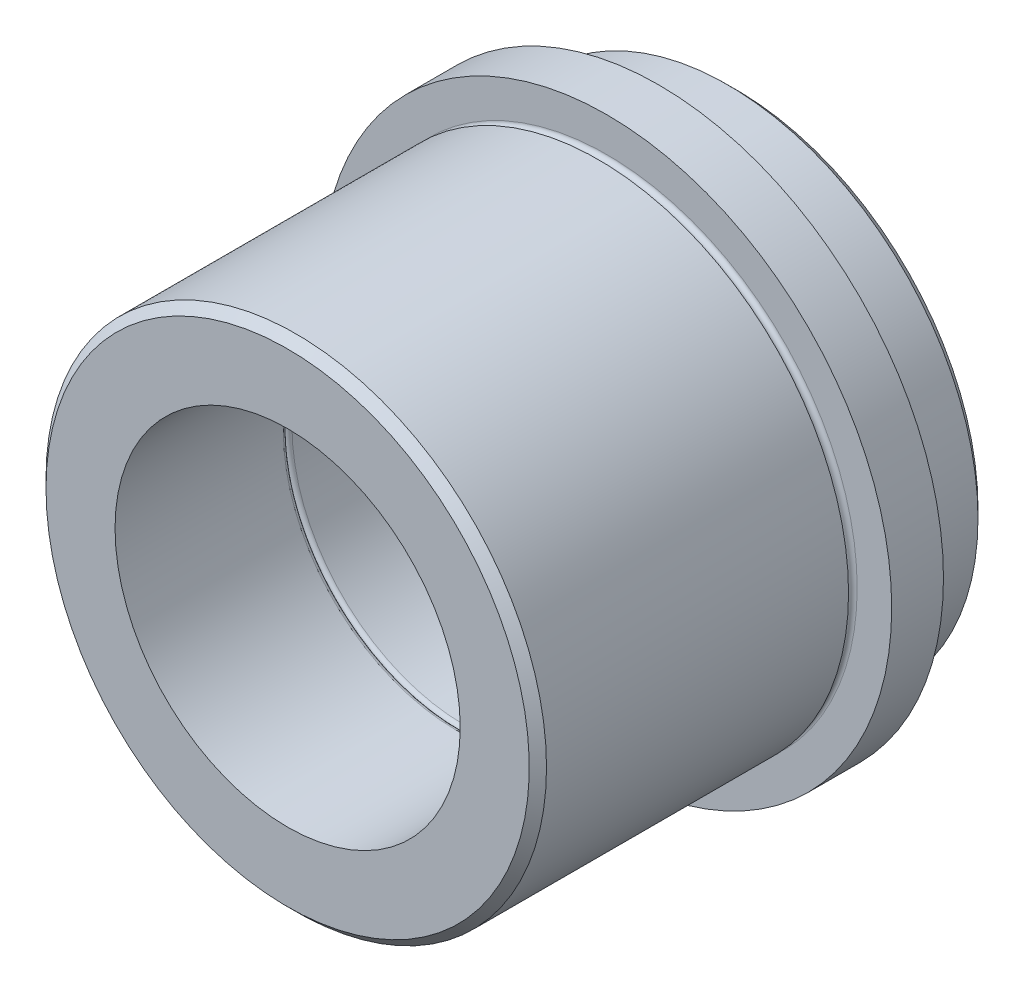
ISO-10303-21;
HEADER;
FILE_DESCRIPTION(('STEP AP214'),'2;1');
FILE_NAME('part.step','',(''),(''),'','','');
FILE_SCHEMA(('AUTOMOTIVE_DESIGN { 1 0 10303 214 1 1 1 1 }'));
ENDSEC;
DATA;
#1=APPLICATION_CONTEXT('core data for automotive mechanical design processes');
#2=APPLICATION_PROTOCOL_DEFINITION('international standard','automotive_design',2000,#1);
#3=PRODUCT_CONTEXT('',#1,'mechanical');
#4=PRODUCT('Part','Part','',(#3));
#5=PRODUCT_RELATED_PRODUCT_CATEGORY('part','',(#4));
#6=PRODUCT_DEFINITION_FORMATION('','',#4);
#7=PRODUCT_DEFINITION_CONTEXT('part definition',#1,'design');
#8=PRODUCT_DEFINITION('design','',#6,#7);
#9=PRODUCT_DEFINITION_SHAPE('','',#8);
#10=(LENGTH_UNIT() NAMED_UNIT(*) SI_UNIT(.MILLI.,.METRE.));
#11=(NAMED_UNIT(*) PLANE_ANGLE_UNIT() SI_UNIT($,.RADIAN.));
#12=(NAMED_UNIT(*) SI_UNIT($,.STERADIAN.) SOLID_ANGLE_UNIT());
#13=UNCERTAINTY_MEASURE_WITH_UNIT(LENGTH_MEASURE(1.E-05),#10,'distance_accuracy_value','');
#14=(GEOMETRIC_REPRESENTATION_CONTEXT(3) GLOBAL_UNCERTAINTY_ASSIGNED_CONTEXT((#13)) GLOBAL_UNIT_ASSIGNED_CONTEXT((#10,
#11,#12)) REPRESENTATION_CONTEXT('',''));
#15=CARTESIAN_POINT('',(0.,0.,0.));
#16=DIRECTION('',(0.,0.,1.));
#17=DIRECTION('',(1.,0.,0.));
#18=AXIS2_PLACEMENT_3D('',#15,#16,#17);
#19=CARTESIAN_POINT('',(0.,0.,0.));
#20=DIRECTION('',(0.,0.,1.));
#21=DIRECTION('',(1.,0.,0.));
#22=AXIS2_PLACEMENT_3D('',#19,#20,#21);
#23=CYLINDRICAL_SURFACE('',#22,20.);
#24=CARTESIAN_POINT('',(0.,0.,-19.5));
#25=DIRECTION('',(0.,0.,1.));
#26=DIRECTION('',(1.,0.,0.));
#27=AXIS2_PLACEMENT_3D('',#24,#25,#26);
#28=CIRCLE('',#27,20.);
#29=CARTESIAN_POINT('',(20.,0.,-19.5));
#30=VERTEX_POINT('',#29);
#31=EDGE_CURVE('E69',#30,#30,#28,.T.);
#32=ORIENTED_EDGE('',*,*,#31,.F.);
#33=EDGE_LOOP('',(#32));
#34=FACE_BOUND('',#33,.T.);
#35=CARTESIAN_POINT('',(0.,0.,0.));
#36=DIRECTION('',(0.,0.,1.));
#37=DIRECTION('',(1.,0.,0.));
#38=AXIS2_PLACEMENT_3D('',#35,#36,#37);
#39=CIRCLE('',#38,20.);
#40=CARTESIAN_POINT('',(20.,0.,0.));
#41=VERTEX_POINT('',#40);
#42=EDGE_CURVE('E33',#41,#41,#39,.T.);
#43=ORIENTED_EDGE('',*,*,#42,.T.);
#44=EDGE_LOOP('',(#43));
#45=FACE_BOUND('',#44,.T.);
#46=ADVANCED_FACE('F13',(#34,#45),#23,.F.);
#47=CARTESIAN_POINT('',(0.,20.,0.));
#48=DIRECTION('',(0.,0.,-1.));
#49=DIRECTION('',(-1.,0.,0.));
#50=AXIS2_PLACEMENT_3D('',#47,#48,#49);
#51=PLANE('',#50);
#52=CARTESIAN_POINT('',(0.,0.,0.));
#53=DIRECTION('',(0.,0.,-1.));
#54=DIRECTION('',(-1.,0.,0.));
#55=AXIS2_PLACEMENT_3D('',#52,#53,#54);
#56=CIRCLE('',#55,28.);
#57=CARTESIAN_POINT('',(-28.,0.,0.));
#58=VERTEX_POINT('',#57);
#59=EDGE_CURVE('E20',#58,#58,#56,.F.);
#60=ORIENTED_EDGE('',*,*,#59,.T.);
#61=EDGE_LOOP('',(#60));
#62=FACE_BOUND('',#61,.T.);
#63=ORIENTED_EDGE('',*,*,#42,.F.);
#64=EDGE_LOOP('',(#63));
#65=FACE_BOUND('',#64,.T.);
#66=ADVANCED_FACE('F77',(#62,#65),#51,.F.);
#67=CARTESIAN_POINT('',(0.,0.,0.));
#68=DIRECTION('',(0.,0.,1.));
#69=DIRECTION('',(1.,0.,0.));
#70=AXIS2_PLACEMENT_3D('',#67,#68,#69);
#71=CYLINDRICAL_SURFACE('',#70,29.);
#72=CARTESIAN_POINT('',(0.,0.,-0.99999999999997));
#73=DIRECTION('',(0.,0.,-1.));
#74=DIRECTION('',(-1.,0.,0.));
#75=AXIS2_PLACEMENT_3D('',#72,#73,#74);
#76=CIRCLE('',#75,29.);
#77=CARTESIAN_POINT('',(-29.,0.,-0.99999999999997));
#78=VERTEX_POINT('',#77);
#79=EDGE_CURVE('E8',#78,#78,#76,.T.);
#80=ORIENTED_EDGE('',*,*,#79,.T.);
#81=EDGE_LOOP('',(#80));
#82=FACE_BOUND('',#81,.T.);
#83=CARTESIAN_POINT('',(0.,0.,-36.));
#84=DIRECTION('',(0.,0.,1.));
#85=DIRECTION('',(1.,0.,0.));
#86=AXIS2_PLACEMENT_3D('',#83,#84,#85);
#87=CIRCLE('',#86,29.);
#88=CARTESIAN_POINT('',(29.,0.,-36.));
#89=VERTEX_POINT('',#88);
#90=EDGE_CURVE('E36',#89,#89,#87,.T.);
#91=ORIENTED_EDGE('',*,*,#90,.T.);
#92=EDGE_LOOP('',(#91));
#93=FACE_BOUND('',#92,.T.);
#94=ADVANCED_FACE('F82',(#82,#93),#71,.T.);
#95=CARTESIAN_POINT('',(0.,0.,-36.5));
#96=DIRECTION('',(0.,0.,1.));
#97=DIRECTION('',(1.,0.,0.));
#98=AXIS2_PLACEMENT_3D('',#95,#96,#97);
#99=TOROIDAL_SURFACE('',#98,29.,0.5);
#100=ORIENTED_EDGE('',*,*,#90,.F.);
#101=EDGE_LOOP('',(#100));
#102=FACE_BOUND('',#101,.T.);
#103=CARTESIAN_POINT('',(0.,0.,-37.));
#104=DIRECTION('',(0.,0.,1.));
#105=DIRECTION('',(1.,0.,0.));
#106=AXIS2_PLACEMENT_3D('',#103,#104,#105);
#107=CIRCLE('',#106,29.);
#108=CARTESIAN_POINT('',(29.,0.,-37.));
#109=VERTEX_POINT('',#108);
#110=EDGE_CURVE('E39',#109,#109,#107,.T.);
#111=ORIENTED_EDGE('',*,*,#110,.T.);
#112=EDGE_LOOP('',(#111));
#113=FACE_BOUND('',#112,.T.);
#114=ADVANCED_FACE('F89',(#102,#113),#99,.F.);
#115=CARTESIAN_POINT('',(0.,29.,-37.));
#116=DIRECTION('',(0.,0.,-1.));
#117=DIRECTION('',(-1.,0.,0.));
#118=AXIS2_PLACEMENT_3D('',#115,#116,#117);
#119=PLANE('',#118);
#120=ORIENTED_EDGE('',*,*,#110,.F.);
#121=EDGE_LOOP('',(#120));
#122=FACE_BOUND('',#121,.T.);
#123=CARTESIAN_POINT('',(0.,0.,-37.));
#124=DIRECTION('',(0.,0.,1.));
#125=DIRECTION('',(1.,0.,0.));
#126=AXIS2_PLACEMENT_3D('',#123,#124,#125);
#127=CIRCLE('',#126,33.);
#128=CARTESIAN_POINT('',(33.,0.,-37.));
#129=VERTEX_POINT('',#128);
#130=EDGE_CURVE('E42',#129,#129,#127,.T.);
#131=ORIENTED_EDGE('',*,*,#130,.T.);
#132=EDGE_LOOP('',(#131));
#133=FACE_BOUND('',#132,.T.);
#134=ADVANCED_FACE('F124',(#122,#133),#119,.F.);
#135=CARTESIAN_POINT('',(0.,0.,0.));
#136=DIRECTION('',(0.,0.,1.));
#137=DIRECTION('',(1.,0.,0.));
#138=AXIS2_PLACEMENT_3D('',#135,#136,#137);
#139=CYLINDRICAL_SURFACE('',#138,33.);
#140=ORIENTED_EDGE('',*,*,#130,.F.);
#141=EDGE_LOOP('',(#140));
#142=FACE_BOUND('',#141,.T.);
#143=CARTESIAN_POINT('',(0.,0.,-43.));
#144=DIRECTION('',(0.,0.,1.));
#145=DIRECTION('',(1.,0.,0.));
#146=AXIS2_PLACEMENT_3D('',#143,#144,#145);
#147=CIRCLE('',#146,33.);
#148=CARTESIAN_POINT('',(33.,0.,-43.));
#149=VERTEX_POINT('',#148);
#150=EDGE_CURVE('E45',#149,#149,#147,.T.);
#151=ORIENTED_EDGE('',*,*,#150,.T.);
#152=EDGE_LOOP('',(#151));
#153=FACE_BOUND('',#152,.T.);
#154=ADVANCED_FACE('F117',(#142,#153),#139,.T.);
#155=CARTESIAN_POINT('',(0.,33.,-43.));
#156=DIRECTION('',(0.,0.,1.));
#157=DIRECTION('',(1.,0.,0.));
#158=AXIS2_PLACEMENT_3D('',#155,#156,#157);
#159=PLANE('',#158);
#160=ORIENTED_EDGE('',*,*,#150,.F.);
#161=EDGE_LOOP('',(#160));
#162=FACE_BOUND('',#161,.T.);
#163=CARTESIAN_POINT('',(0.,0.,-43.));
#164=DIRECTION('',(0.,0.,1.));
#165=DIRECTION('',(1.,0.,0.));
#166=AXIS2_PLACEMENT_3D('',#163,#164,#165);
#167=CIRCLE('',#166,29.);
#168=CARTESIAN_POINT('',(29.,0.,-43.));
#169=VERTEX_POINT('',#168);
#170=EDGE_CURVE('E48',#169,#169,#167,.T.);
#171=ORIENTED_EDGE('',*,*,#170,.T.);
#172=EDGE_LOOP('',(#171));
#173=FACE_BOUND('',#172,.T.);
#174=ADVANCED_FACE('F112',(#162,#173),#159,.F.);
#175=CARTESIAN_POINT('',(0.,0.,0.));
#176=DIRECTION('',(0.,0.,1.));
#177=DIRECTION('',(1.,0.,0.));
#178=AXIS2_PLACEMENT_3D('',#175,#176,#177);
#179=CYLINDRICAL_SURFACE('',#178,29.);
#180=CARTESIAN_POINT('',(0.,0.,-51.));
#181=DIRECTION('',(0.,0.,1.));
#182=DIRECTION('',(1.,0.,0.));
#183=AXIS2_PLACEMENT_3D('',#180,#181,#182);
#184=CIRCLE('',#183,29.);
#185=CARTESIAN_POINT('',(29.,0.,-51.));
#186=VERTEX_POINT('',#185);
#187=EDGE_CURVE('E28',#186,#186,#184,.T.);
#188=ORIENTED_EDGE('',*,*,#187,.T.);
#189=EDGE_LOOP('',(#188));
#190=FACE_BOUND('',#189,.T.);
#191=ORIENTED_EDGE('',*,*,#170,.F.);
#192=EDGE_LOOP('',(#191));
#193=FACE_BOUND('',#192,.T.);
#194=ADVANCED_FACE('F108',(#190,#193),#179,.T.);
#195=CARTESIAN_POINT('',(0.,29.,-52.));
#196=DIRECTION('',(0.,0.,1.));
#197=DIRECTION('',(1.,0.,0.));
#198=AXIS2_PLACEMENT_3D('',#195,#196,#197);
#199=PLANE('',#198);
#200=CARTESIAN_POINT('',(0.,0.,-52.));
#201=DIRECTION('',(0.,0.,1.));
#202=DIRECTION('',(1.,0.,0.));
#203=AXIS2_PLACEMENT_3D('',#200,#201,#202);
#204=CIRCLE('',#203,28.);
#205=CARTESIAN_POINT('',(28.,0.,-52.));
#206=VERTEX_POINT('',#205);
#207=EDGE_CURVE('E24',#206,#206,#204,.F.);
#208=ORIENTED_EDGE('',*,*,#207,.T.);
#209=EDGE_LOOP('',(#208));
#210=FACE_BOUND('',#209,.T.);
#211=CARTESIAN_POINT('',(0.,0.,-52.));
#212=DIRECTION('',(0.,0.,1.));
#213=DIRECTION('',(1.,0.,0.));
#214=AXIS2_PLACEMENT_3D('',#211,#212,#213);
#215=CIRCLE('',#214,20.);
#216=CARTESIAN_POINT('',(20.,0.,-52.));
#217=VERTEX_POINT('',#216);
#218=EDGE_CURVE('E51',#217,#217,#215,.T.);
#219=ORIENTED_EDGE('',*,*,#218,.T.);
#220=EDGE_LOOP('',(#219));
#221=FACE_BOUND('',#220,.T.);
#222=ADVANCED_FACE('F111',(#210,#221),#199,.F.);
#223=CARTESIAN_POINT('',(0.,0.,0.));
#224=DIRECTION('',(0.,0.,1.));
#225=DIRECTION('',(1.,0.,0.));
#226=AXIS2_PLACEMENT_3D('',#223,#224,#225);
#227=CYLINDRICAL_SURFACE('',#226,20.);
#228=ORIENTED_EDGE('',*,*,#218,.F.);
#229=EDGE_LOOP('',(#228));
#230=FACE_BOUND('',#229,.T.);
#231=CARTESIAN_POINT('',(0.,0.,-40.5));
#232=DIRECTION('',(0.,0.,1.));
#233=DIRECTION('',(1.,0.,0.));
#234=AXIS2_PLACEMENT_3D('',#231,#232,#233);
#235=CIRCLE('',#234,20.);
#236=CARTESIAN_POINT('',(20.,0.,-40.5));
#237=VERTEX_POINT('',#236);
#238=EDGE_CURVE('E54',#237,#237,#235,.T.);
#239=ORIENTED_EDGE('',*,*,#238,.T.);
#240=EDGE_LOOP('',(#239));
#241=FACE_BOUND('',#240,.T.);
#242=ADVANCED_FACE('F240',(#230,#241),#227,.F.);
#243=CARTESIAN_POINT('',(0.,0.,-40.5));
#244=DIRECTION('',(0.,0.,1.));
#245=DIRECTION('',(1.,0.,0.));
#246=AXIS2_PLACEMENT_3D('',#243,#244,#245);
#247=TOROIDAL_SURFACE('',#246,20.5,0.5);
#248=ORIENTED_EDGE('',*,*,#238,.F.);
#249=EDGE_LOOP('',(#248));
#250=FACE_BOUND('',#249,.T.);
#251=CARTESIAN_POINT('',(0.,0.,-40.));
#252=DIRECTION('',(0.,0.,1.));
#253=DIRECTION('',(1.,0.,0.));
#254=AXIS2_PLACEMENT_3D('',#251,#252,#253);
#255=CIRCLE('',#254,20.5);
#256=CARTESIAN_POINT('',(20.5,0.,-40.));
#257=VERTEX_POINT('',#256);
#258=EDGE_CURVE('E57',#257,#257,#255,.T.);
#259=ORIENTED_EDGE('',*,*,#258,.T.);
#260=EDGE_LOOP('',(#259));
#261=FACE_BOUND('',#260,.T.);
#262=ADVANCED_FACE('F231',(#250,#261),#247,.T.);
#263=CARTESIAN_POINT('',(0.,0.,-39.5));
#264=DIRECTION('',(0.,0.,1.));
#265=DIRECTION('',(1.,0.,0.));
#266=AXIS2_PLACEMENT_3D('',#263,#264,#265);
#267=TOROIDAL_SURFACE('',#266,20.5,0.5);
#268=ORIENTED_EDGE('',*,*,#258,.F.);
#269=EDGE_LOOP('',(#268));
#270=FACE_BOUND('',#269,.T.);
#271=CARTESIAN_POINT('',(0.,0.,-39.5));
#272=DIRECTION('',(0.,0.,1.));
#273=DIRECTION('',(1.,0.,0.));
#274=AXIS2_PLACEMENT_3D('',#271,#272,#273);
#275=CIRCLE('',#274,20.);
#276=CARTESIAN_POINT('',(20.,0.,-39.5));
#277=VERTEX_POINT('',#276);
#278=EDGE_CURVE('E60',#277,#277,#275,.T.);
#279=ORIENTED_EDGE('',*,*,#278,.T.);
#280=EDGE_LOOP('',(#279));
#281=FACE_BOUND('',#280,.T.);
#282=ADVANCED_FACE('F222',(#270,#281),#267,.T.);
#283=CARTESIAN_POINT('',(0.,0.,0.));
#284=DIRECTION('',(0.,0.,1.));
#285=DIRECTION('',(1.,0.,0.));
#286=AXIS2_PLACEMENT_3D('',#283,#284,#285);
#287=CYLINDRICAL_SURFACE('',#286,20.);
#288=ORIENTED_EDGE('',*,*,#278,.F.);
#289=EDGE_LOOP('',(#288));
#290=FACE_BOUND('',#289,.T.);
#291=CARTESIAN_POINT('',(0.,0.,-20.5));
#292=DIRECTION('',(0.,0.,1.));
#293=DIRECTION('',(1.,0.,0.));
#294=AXIS2_PLACEMENT_3D('',#291,#292,#293);
#295=CIRCLE('',#294,20.);
#296=CARTESIAN_POINT('',(20.,0.,-20.5));
#297=VERTEX_POINT('',#296);
#298=EDGE_CURVE('E63',#297,#297,#295,.T.);
#299=ORIENTED_EDGE('',*,*,#298,.T.);
#300=EDGE_LOOP('',(#299));
#301=FACE_BOUND('',#300,.T.);
#302=ADVANCED_FACE('F214',(#290,#301),#287,.F.);
#303=CARTESIAN_POINT('',(0.,0.,-20.5));
#304=DIRECTION('',(0.,0.,1.));
#305=DIRECTION('',(1.,0.,0.));
#306=AXIS2_PLACEMENT_3D('',#303,#304,#305);
#307=TOROIDAL_SURFACE('',#306,20.5,0.5);
#308=ORIENTED_EDGE('',*,*,#298,.F.);
#309=EDGE_LOOP('',(#308));
#310=FACE_BOUND('',#309,.T.);
#311=CARTESIAN_POINT('',(0.,0.,-20.));
#312=DIRECTION('',(0.,0.,1.));
#313=DIRECTION('',(1.,0.,0.));
#314=AXIS2_PLACEMENT_3D('',#311,#312,#313);
#315=CIRCLE('',#314,20.5);
#316=CARTESIAN_POINT('',(20.5,0.,-20.));
#317=VERTEX_POINT('',#316);
#318=EDGE_CURVE('E66',#317,#317,#315,.T.);
#319=ORIENTED_EDGE('',*,*,#318,.T.);
#320=EDGE_LOOP('',(#319));
#321=FACE_BOUND('',#320,.T.);
#322=ADVANCED_FACE('F101',(#310,#321),#307,.T.);
#323=CARTESIAN_POINT('',(0.,0.,-19.5));
#324=DIRECTION('',(0.,0.,1.));
#325=DIRECTION('',(1.,0.,0.));
#326=AXIS2_PLACEMENT_3D('',#323,#324,#325);
#327=TOROIDAL_SURFACE('',#326,20.5,0.5);
#328=ORIENTED_EDGE('',*,*,#318,.F.);
#329=EDGE_LOOP('',(#328));
#330=FACE_BOUND('',#329,.T.);
#331=ORIENTED_EDGE('',*,*,#31,.T.);
#332=EDGE_LOOP('',(#331));
#333=FACE_BOUND('',#332,.T.);
#334=ADVANCED_FACE('F73',(#330,#333),#327,.T.);
#335=CARTESIAN_POINT('',(0.,0.,-51.));
#336=DIRECTION('',(0.,0.,1.));
#337=DIRECTION('',(1.,0.,0.));
#338=AXIS2_PLACEMENT_3D('',#335,#336,#337);
#339=CONICAL_SURFACE('',#338,29.,0.785398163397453);
#340=ORIENTED_EDGE('',*,*,#207,.F.);
#341=EDGE_LOOP('',(#340));
#342=FACE_BOUND('',#341,.T.);
#343=ORIENTED_EDGE('',*,*,#187,.F.);
#344=EDGE_LOOP('',(#343));
#345=FACE_BOUND('',#344,.T.);
#346=ADVANCED_FACE('F92',(#342,#345),#339,.T.);
#347=CARTESIAN_POINT('',(0.,0.,0.));
#348=DIRECTION('',(0.,0.,-1.));
#349=DIRECTION('',(-1.,0.,0.));
#350=AXIS2_PLACEMENT_3D('',#347,#348,#349);
#351=CONICAL_SURFACE('',#350,28.,0.785398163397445);
#352=ORIENTED_EDGE('',*,*,#79,.F.);
#353=EDGE_LOOP('',(#352));
#354=FACE_BOUND('',#353,.T.);
#355=ORIENTED_EDGE('',*,*,#59,.F.);
#356=EDGE_LOOP('',(#355));
#357=FACE_BOUND('',#356,.T.);
#358=ADVANCED_FACE('F15',(#354,#357),#351,.T.);
#359=CLOSED_SHELL('',(#46,#66,#94,#114,#134,#154,#174,#194,#222,#242,#262,#282,#302,#322,#334,
#346,#358));
#360=MANIFOLD_SOLID_BREP('B1',#359);
#361=ADVANCED_BREP_SHAPE_REPRESENTATION('',(#18,#360),#14);
#362=SHAPE_DEFINITION_REPRESENTATION(#9,#361);
ENDSEC;
END-ISO-10303-21;
